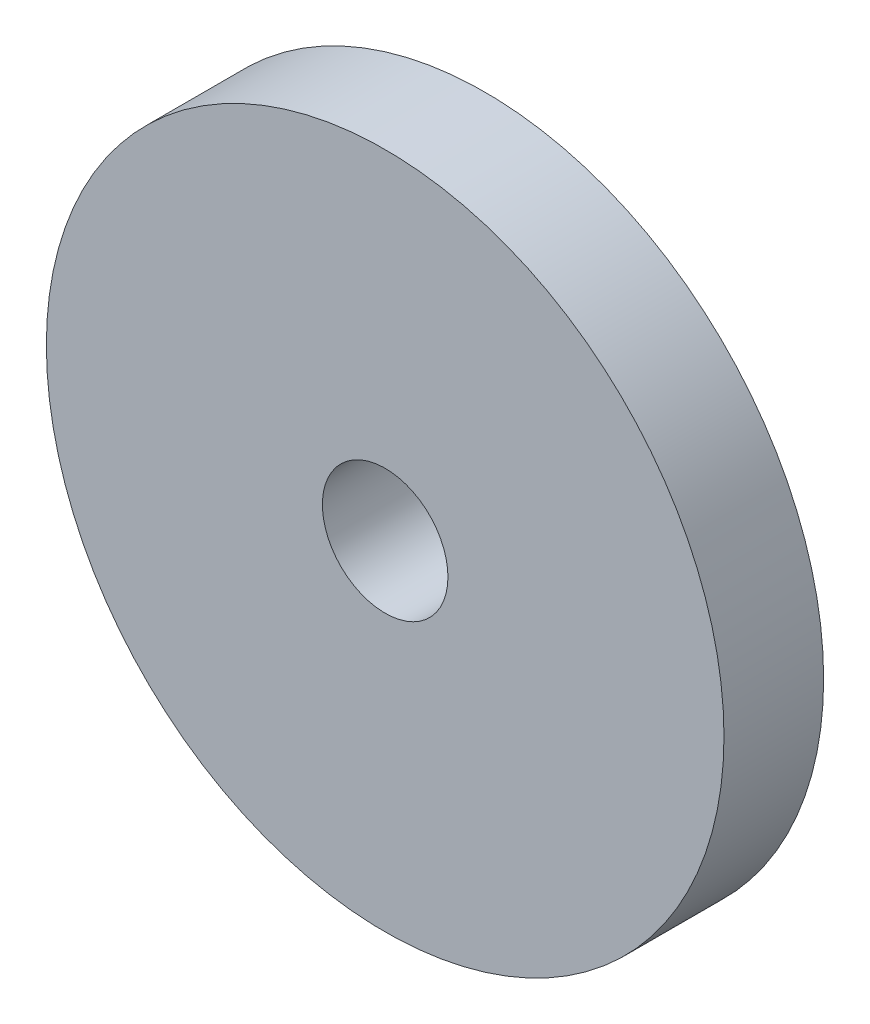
ISO-10303-21;
HEADER;
FILE_DESCRIPTION(('STEP AP214'),'2;1');
FILE_NAME('part.step','',(''),(''),'','','');
FILE_SCHEMA(('AUTOMOTIVE_DESIGN { 1 0 10303 214 1 1 1 1 }'));
ENDSEC;
DATA;
#1=APPLICATION_CONTEXT('core data for automotive mechanical design processes');
#2=APPLICATION_PROTOCOL_DEFINITION('international standard','automotive_design',2000,#1);
#3=PRODUCT_CONTEXT('',#1,'mechanical');
#4=PRODUCT('Part','Part','',(#3));
#5=PRODUCT_RELATED_PRODUCT_CATEGORY('part','',(#4));
#6=PRODUCT_DEFINITION_FORMATION('','',#4);
#7=PRODUCT_DEFINITION_CONTEXT('part definition',#1,'design');
#8=PRODUCT_DEFINITION('design','',#6,#7);
#9=PRODUCT_DEFINITION_SHAPE('','',#8);
#10=(LENGTH_UNIT() NAMED_UNIT(*) SI_UNIT(.MILLI.,.METRE.));
#11=(NAMED_UNIT(*) PLANE_ANGLE_UNIT() SI_UNIT($,.RADIAN.));
#12=(NAMED_UNIT(*) SI_UNIT($,.STERADIAN.) SOLID_ANGLE_UNIT());
#13=UNCERTAINTY_MEASURE_WITH_UNIT(LENGTH_MEASURE(1.E-05),#10,'distance_accuracy_value','');
#14=(GEOMETRIC_REPRESENTATION_CONTEXT(3) GLOBAL_UNCERTAINTY_ASSIGNED_CONTEXT((#13)) GLOBAL_UNIT_ASSIGNED_CONTEXT((#10,
#11,#12)) REPRESENTATION_CONTEXT('',''));
#15=CARTESIAN_POINT('',(0.,0.,0.));
#16=DIRECTION('',(0.,0.,1.));
#17=DIRECTION('',(1.,0.,0.));
#18=AXIS2_PLACEMENT_3D('',#15,#16,#17);
#19=CARTESIAN_POINT('',(0.,0.,5.));
#20=DIRECTION('',(0.,0.,1.));
#21=DIRECTION('',(1.,0.,0.));
#22=AXIS2_PLACEMENT_3D('',#19,#20,#21);
#23=PLANE('',#22);
#24=CARTESIAN_POINT('',(0.,0.,5.));
#25=DIRECTION('',(0.,0.,1.));
#26=DIRECTION('',(1.,0.,0.));
#27=AXIS2_PLACEMENT_3D('',#24,#25,#26);
#28=CIRCLE('',#27,17.);
#29=CARTESIAN_POINT('',(17.,0.,5.));
#30=VERTEX_POINT('',#29);
#31=EDGE_CURVE('E10',#30,#30,#28,.T.);
#32=ORIENTED_EDGE('',*,*,#31,.T.);
#33=EDGE_LOOP('',(#32));
#34=FACE_BOUND('',#33,.T.);
#35=CARTESIAN_POINT('',(0.,0.,5.));
#36=DIRECTION('',(0.,0.,1.));
#37=DIRECTION('',(1.,0.,0.));
#38=AXIS2_PLACEMENT_3D('',#35,#36,#37);
#39=CIRCLE('',#38,3.15);
#40=CARTESIAN_POINT('',(3.15,0.,5.));
#41=VERTEX_POINT('',#40);
#42=EDGE_CURVE('E35',#41,#41,#39,.T.);
#43=ORIENTED_EDGE('',*,*,#42,.F.);
#44=EDGE_LOOP('',(#43));
#45=FACE_BOUND('',#44,.T.);
#46=ADVANCED_FACE('F24',(#34,#45),#23,.T.);
#47=CARTESIAN_POINT('',(0.,0.,0.));
#48=DIRECTION('',(0.,0.,1.));
#49=DIRECTION('',(1.,0.,0.));
#50=AXIS2_PLACEMENT_3D('',#47,#48,#49);
#51=PLANE('',#50);
#52=CARTESIAN_POINT('',(0.,0.,0.));
#53=DIRECTION('',(0.,0.,1.));
#54=DIRECTION('',(1.,0.,0.));
#55=AXIS2_PLACEMENT_3D('',#52,#53,#54);
#56=CIRCLE('',#55,17.);
#57=CARTESIAN_POINT('',(17.,0.,0.));
#58=VERTEX_POINT('',#57);
#59=EDGE_CURVE('E31',#58,#58,#56,.T.);
#60=ORIENTED_EDGE('',*,*,#59,.F.);
#61=EDGE_LOOP('',(#60));
#62=FACE_BOUND('',#61,.T.);
#63=CARTESIAN_POINT('',(0.,0.,0.));
#64=DIRECTION('',(0.,0.,1.));
#65=DIRECTION('',(1.,0.,0.));
#66=AXIS2_PLACEMENT_3D('',#63,#64,#65);
#67=CIRCLE('',#66,3.15);
#68=CARTESIAN_POINT('',(3.15,0.,0.));
#69=VERTEX_POINT('',#68);
#70=EDGE_CURVE('E39',#69,#69,#67,.T.);
#71=ORIENTED_EDGE('',*,*,#70,.T.);
#72=EDGE_LOOP('',(#71));
#73=FACE_BOUND('',#72,.T.);
#74=ADVANCED_FACE('F45',(#62,#73),#51,.F.);
#75=CARTESIAN_POINT('',(0.,0.,5.));
#76=DIRECTION('',(0.,0.,-1.));
#77=DIRECTION('',(-1.,0.,0.));
#78=AXIS2_PLACEMENT_3D('',#75,#76,#77);
#79=CYLINDRICAL_SURFACE('',#78,17.);
#80=ORIENTED_EDGE('',*,*,#31,.F.);
#81=EDGE_LOOP('',(#80));
#82=FACE_BOUND('',#81,.T.);
#83=ORIENTED_EDGE('',*,*,#59,.T.);
#84=EDGE_LOOP('',(#83));
#85=FACE_BOUND('',#84,.T.);
#86=ADVANCED_FACE('F26',(#82,#85),#79,.T.);
#87=CARTESIAN_POINT('',(0.,0.,5.));
#88=DIRECTION('',(0.,0.,-1.));
#89=DIRECTION('',(-1.,0.,0.));
#90=AXIS2_PLACEMENT_3D('',#87,#88,#89);
#91=CYLINDRICAL_SURFACE('',#90,3.15);
#92=ORIENTED_EDGE('',*,*,#42,.T.);
#93=EDGE_LOOP('',(#92));
#94=FACE_BOUND('',#93,.T.);
#95=ORIENTED_EDGE('',*,*,#70,.F.);
#96=EDGE_LOOP('',(#95));
#97=FACE_BOUND('',#96,.T.);
#98=ADVANCED_FACE('F47',(#94,#97),#91,.F.);
#99=CLOSED_SHELL('',(#46,#74,#86,#98));
#100=MANIFOLD_SOLID_BREP('B2',#99);
#101=ADVANCED_BREP_SHAPE_REPRESENTATION('',(#18,#100),#14);
#102=SHAPE_DEFINITION_REPRESENTATION(#9,#101);
ENDSEC;
END-ISO-10303-21;
